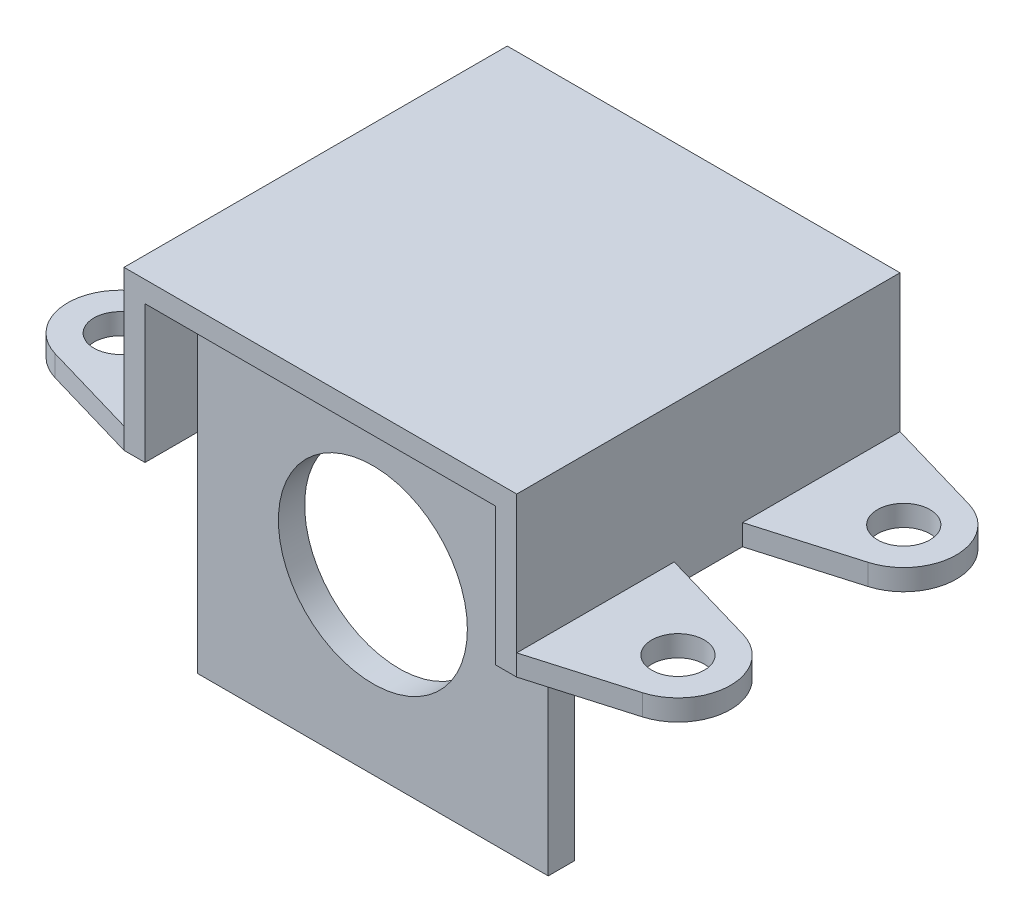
from build123d import *

# Parameters (mm, degrees)
SKETCH1_W           = 42.418
SKETCH1_H           = 41.91
SKETCH1_R           = 11.43
BOSS_EXTRUDE1_DEPTH = 3.175
SKETCH2_W           = 42.418
SKETCH2_H           = 46.355
BOSS_EXTRUDE2_DEPTH = 2.54
SKETCH3_W           = 46.355
SKETCH3_H           = 19.177
BOSS_EXTRUDE3_DEPTH = 2.54
SKETCH4_R           = 3.175
BOSS_EXTRUDE4_DEPTH = 2.54
SKETCH5_W           = 42.418
SKETCH5_H           = 16.637
BOSS_EXTRUDE5_DEPTH = 2.54


with BuildPart() as part:
    # Sketch1 → Boss-Extrude1 (new body)
    with BuildSketch(Plane.XY):
        with Locations((-5.383017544, -7.413903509)):
            Rectangle(SKETCH1_W, SKETCH1_H)
        with Locations((-5.383017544, -7.413903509)):
            Circle(SKETCH1_R, mode=Mode.SUBTRACT)
    extrude(amount=BOSS_EXTRUDE1_DEPTH)

    # Sketch2 → Boss-Extrude2 (add)
    with BuildSketch(Plane(origin=(0, 13.541096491, 0), x_dir=(1, 0, 0), z_dir=(0, 1, 0))):
        with Locations((-5.383017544, 13.6525)):
            Rectangle(SKETCH2_W, SKETCH2_H)
    extrude(amount=BOSS_EXTRUDE2_DEPTH)

    # Sketch3 → Boss-Extrude3 (add)
    with BuildSketch(Plane(origin=(15.825982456, 0, 0), x_dir=(0, 0, -1), z_dir=(1, 0, 0))):
        with Locations((13.6525, 6.492596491)):
            Rectangle(SKETCH3_W, SKETCH3_H)
    boss_extrude3 = extrude(amount=BOSS_EXTRUDE3_DEPTH)

    # Sketch4 → Boss-Extrude4 (add)
    # profile 1 of 2: a face of its own
    with BuildSketch(Plane.XZ.offset(3.095903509)):
        with BuildLine():
            Line((18.365982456, -36.83), (30.125699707, -33.401031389))
            ThreePointArc((30.125699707, -33.401031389), (34.698077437, -27.305), (30.125699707, -21.208968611))
            Line((30.125699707, -21.208968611), (18.365982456, -17.78))
            Line((18.365982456, -17.78), (18.365982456, -27.305))
            Line((18.365982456, -27.305), (18.365982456, -36.83))
        make_face()
        with Locations((28.348182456, -27.305)):
            Circle(SKETCH4_R, mode=Mode.SUBTRACT)
    # profile 2 of 2: a face of its own
    with BuildSketch(Plane.XZ.offset(3.095903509)):
        with BuildLine():
            Line((18.365982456, 9.525), (30.125676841, 6.096147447))
            ThreePointArc((30.125676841, 6.096147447), (34.698182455, 0), (30.125676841, -6.096147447))
            Line((30.125676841, -6.096147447), (18.365982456, -9.525))
            Line((18.365982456, -9.525), (18.365982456, 0))
            Line((18.365982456, 0), (18.365982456, 9.525))
        make_face()
        with Locations((28.348182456, 0)):
            Circle(SKETCH4_R, mode=Mode.SUBTRACT)
    boss_extrude4 = extrude(amount=-BOSS_EXTRUDE4_DEPTH)

    # Mirror1: Boss-Extrude3, Boss-Extrude4 across plane
    add(boss_extrude3.mirror(Plane.ZY.offset(5.383017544)))
    add(boss_extrude4.mirror(Plane.ZY.offset(5.383017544)))

    # Sketch5 → Boss-Extrude5 (add)
    with BuildSketch(Plane(origin=(0, 0, -36.83), x_dir=(-1, 0, 0), z_dir=(0, 0, -1))):
        with Locations((5.383017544, 5.222596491)):
            Rectangle(SKETCH5_W, SKETCH5_H)
    extrude(amount=-BOSS_EXTRUDE5_DEPTH)


solid = part.part
